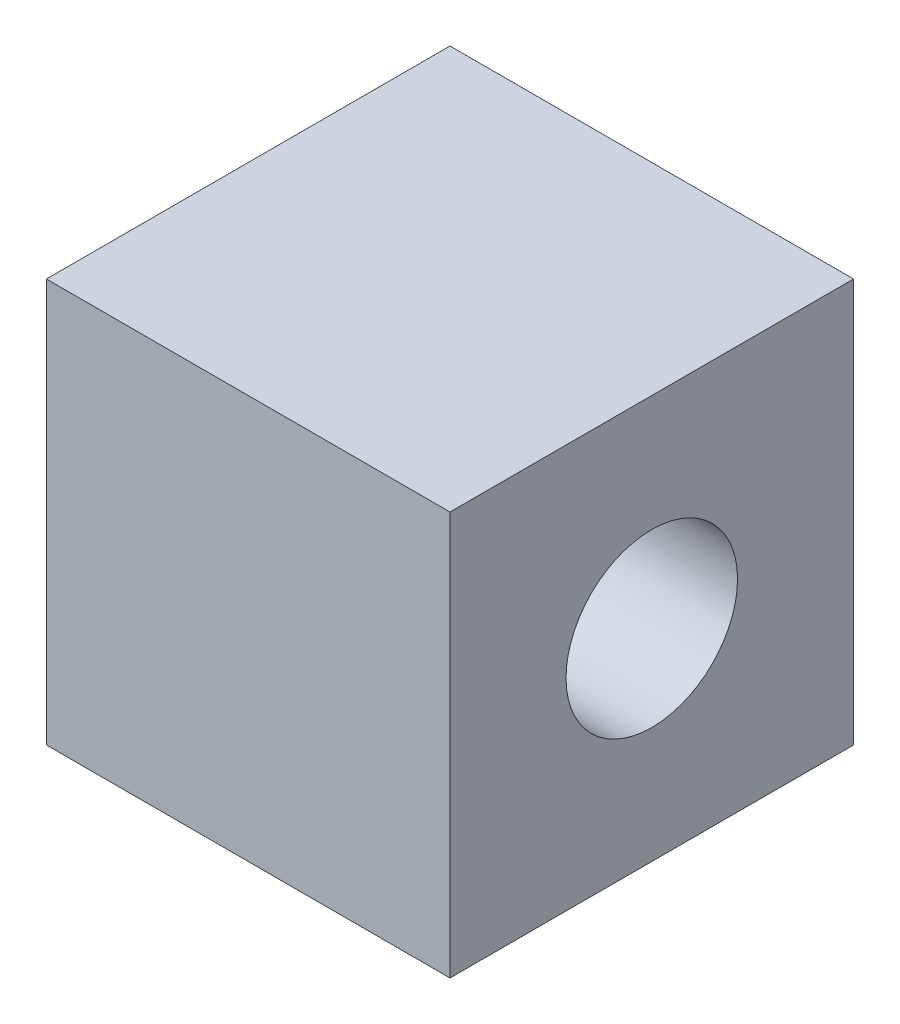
ISO-10303-21;
HEADER;
FILE_DESCRIPTION(('STEP AP214'),'2;1');
FILE_NAME('part.step','',(''),(''),'','','');
FILE_SCHEMA(('AUTOMOTIVE_DESIGN { 1 0 10303 214 1 1 1 1 }'));
ENDSEC;
DATA;
#1=APPLICATION_CONTEXT('core data for automotive mechanical design processes');
#2=APPLICATION_PROTOCOL_DEFINITION('international standard','automotive_design',2000,#1);
#3=PRODUCT_CONTEXT('',#1,'mechanical');
#4=PRODUCT('Part','Part','',(#3));
#5=PRODUCT_RELATED_PRODUCT_CATEGORY('part','',(#4));
#6=PRODUCT_DEFINITION_FORMATION('','',#4);
#7=PRODUCT_DEFINITION_CONTEXT('part definition',#1,'design');
#8=PRODUCT_DEFINITION('design','',#6,#7);
#9=PRODUCT_DEFINITION_SHAPE('','',#8);
#10=(LENGTH_UNIT() NAMED_UNIT(*) SI_UNIT(.MILLI.,.METRE.));
#11=(NAMED_UNIT(*) PLANE_ANGLE_UNIT() SI_UNIT($,.RADIAN.));
#12=(NAMED_UNIT(*) SI_UNIT($,.STERADIAN.) SOLID_ANGLE_UNIT());
#13=UNCERTAINTY_MEASURE_WITH_UNIT(LENGTH_MEASURE(1.E-05),#10,'distance_accuracy_value','');
#14=(GEOMETRIC_REPRESENTATION_CONTEXT(3) GLOBAL_UNCERTAINTY_ASSIGNED_CONTEXT((#13)) GLOBAL_UNIT_ASSIGNED_CONTEXT((#10,
#11,#12)) REPRESENTATION_CONTEXT('',''));
#15=CARTESIAN_POINT('',(0.,0.,0.));
#16=DIRECTION('',(0.,0.,1.));
#17=DIRECTION('',(1.,0.,0.));
#18=AXIS2_PLACEMENT_3D('',#15,#16,#17);
#19=CARTESIAN_POINT('',(20.,-10.,-10.));
#20=DIRECTION('',(0.,0.,1.));
#21=DIRECTION('',(1.,0.,0.));
#22=AXIS2_PLACEMENT_3D('',#19,#20,#21);
#23=PLANE('',#22);
#24=DIRECTION('',(0.,1.,0.));
#25=VECTOR('',#24,1.);
#26=CARTESIAN_POINT('',(0.,-10.,-10.));
#27=LINE('',#26,#25);
#28=CARTESIAN_POINT('',(0.,-10.,-10.));
#29=VERTEX_POINT('',#28);
#30=CARTESIAN_POINT('',(0.,10.,-10.));
#31=VERTEX_POINT('',#30);
#32=EDGE_CURVE('E113',#29,#31,#27,.T.);
#33=ORIENTED_EDGE('',*,*,#32,.T.);
#34=DIRECTION('',(-1.,0.,0.));
#35=VECTOR('',#34,1.);
#36=CARTESIAN_POINT('',(20.,10.,-10.));
#37=LINE('',#36,#35);
#38=CARTESIAN_POINT('',(20.,10.,-10.));
#39=VERTEX_POINT('',#38);
#40=EDGE_CURVE('E11',#39,#31,#37,.T.);
#41=ORIENTED_EDGE('',*,*,#40,.F.);
#42=DIRECTION('',(0.,1.,0.));
#43=VECTOR('',#42,1.);
#44=CARTESIAN_POINT('',(20.,-10.,-10.));
#45=LINE('',#44,#43);
#46=CARTESIAN_POINT('',(20.,-10.,-10.));
#47=VERTEX_POINT('',#46);
#48=EDGE_CURVE('E97',#47,#39,#45,.T.);
#49=ORIENTED_EDGE('',*,*,#48,.F.);
#50=DIRECTION('',(-1.,0.,0.));
#51=VECTOR('',#50,1.);
#52=CARTESIAN_POINT('',(20.,-10.,-10.));
#53=LINE('',#52,#51);
#54=EDGE_CURVE('E109',#47,#29,#53,.T.);
#55=ORIENTED_EDGE('',*,*,#54,.T.);
#56=EDGE_LOOP('',(#33,#41,#49,#55));
#57=FACE_BOUND('',#56,.T.);
#58=ADVANCED_FACE('F45',(#57),#23,.F.);
#59=CARTESIAN_POINT('',(20.,10.,10.));
#60=DIRECTION('',(0.,-1.,0.));
#61=DIRECTION('',(0.,0.,-1.));
#62=AXIS2_PLACEMENT_3D('',#59,#60,#61);
#63=PLANE('',#62);
#64=DIRECTION('',(0.,0.,1.));
#65=VECTOR('',#64,1.);
#66=CARTESIAN_POINT('',(0.,10.,10.));
#67=LINE('',#66,#65);
#68=CARTESIAN_POINT('',(0.,10.,10.));
#69=VERTEX_POINT('',#68);
#70=EDGE_CURVE('E102',#31,#69,#67,.T.);
#71=ORIENTED_EDGE('',*,*,#70,.T.);
#72=DIRECTION('',(-1.,0.,0.));
#73=VECTOR('',#72,1.);
#74=CARTESIAN_POINT('',(20.,10.,10.));
#75=LINE('',#74,#73);
#76=CARTESIAN_POINT('',(20.,10.,10.));
#77=VERTEX_POINT('',#76);
#78=EDGE_CURVE('E54',#77,#69,#75,.T.);
#79=ORIENTED_EDGE('',*,*,#78,.F.);
#80=DIRECTION('',(0.,0.,1.));
#81=VECTOR('',#80,1.);
#82=CARTESIAN_POINT('',(20.,10.,10.));
#83=LINE('',#82,#81);
#84=EDGE_CURVE('E92',#39,#77,#83,.T.);
#85=ORIENTED_EDGE('',*,*,#84,.F.);
#86=ORIENTED_EDGE('',*,*,#40,.T.);
#87=EDGE_LOOP('',(#71,#79,#85,#86));
#88=FACE_BOUND('',#87,.T.);
#89=ADVANCED_FACE('F101',(#88),#63,.F.);
#90=CARTESIAN_POINT('',(20.,-10.,10.));
#91=DIRECTION('',(0.,0.,-1.));
#92=DIRECTION('',(-1.,0.,0.));
#93=AXIS2_PLACEMENT_3D('',#90,#91,#92);
#94=PLANE('',#93);
#95=DIRECTION('',(0.,-1.,0.));
#96=VECTOR('',#95,1.);
#97=CARTESIAN_POINT('',(0.,-10.,10.));
#98=LINE('',#97,#96);
#99=CARTESIAN_POINT('',(0.,-10.,10.));
#100=VERTEX_POINT('',#99);
#101=EDGE_CURVE('E79',#69,#100,#98,.T.);
#102=ORIENTED_EDGE('',*,*,#101,.T.);
#103=DIRECTION('',(-1.,0.,0.));
#104=VECTOR('',#103,1.);
#105=CARTESIAN_POINT('',(20.,-10.,10.));
#106=LINE('',#105,#104);
#107=CARTESIAN_POINT('',(20.,-10.,10.));
#108=VERTEX_POINT('',#107);
#109=EDGE_CURVE('E104',#108,#100,#106,.T.);
#110=ORIENTED_EDGE('',*,*,#109,.F.);
#111=DIRECTION('',(0.,-1.,0.));
#112=VECTOR('',#111,1.);
#113=CARTESIAN_POINT('',(20.,-10.,10.));
#114=LINE('',#113,#112);
#115=EDGE_CURVE('E95',#77,#108,#114,.T.);
#116=ORIENTED_EDGE('',*,*,#115,.F.);
#117=ORIENTED_EDGE('',*,*,#78,.T.);
#118=EDGE_LOOP('',(#102,#110,#116,#117));
#119=FACE_BOUND('',#118,.T.);
#120=ADVANCED_FACE('F105',(#119),#94,.F.);
#121=CARTESIAN_POINT('',(20.,-10.,10.));
#122=DIRECTION('',(0.,1.,0.));
#123=DIRECTION('',(0.,0.,1.));
#124=AXIS2_PLACEMENT_3D('',#121,#122,#123);
#125=PLANE('',#124);
#126=DIRECTION('',(0.,0.,-1.));
#127=VECTOR('',#126,1.);
#128=CARTESIAN_POINT('',(0.,-10.,10.));
#129=LINE('',#128,#127);
#130=EDGE_CURVE('E85',#100,#29,#129,.T.);
#131=ORIENTED_EDGE('',*,*,#130,.T.);
#132=ORIENTED_EDGE('',*,*,#54,.F.);
#133=DIRECTION('',(0.,0.,-1.));
#134=VECTOR('',#133,1.);
#135=CARTESIAN_POINT('',(20.,-10.,10.));
#136=LINE('',#135,#134);
#137=EDGE_CURVE('E62',#108,#47,#136,.T.);
#138=ORIENTED_EDGE('',*,*,#137,.F.);
#139=ORIENTED_EDGE('',*,*,#109,.T.);
#140=EDGE_LOOP('',(#131,#132,#138,#139));
#141=FACE_BOUND('',#140,.T.);
#142=ADVANCED_FACE('F127',(#141),#125,.F.);
#143=CARTESIAN_POINT('',(20.,0.,0.));
#144=DIRECTION('',(-1.,0.,0.));
#145=DIRECTION('',(0.,0.,1.));
#146=AXIS2_PLACEMENT_3D('',#143,#144,#145);
#147=PLANE('',#146);
#148=CARTESIAN_POINT('',(20.,0.,0.));
#149=DIRECTION('',(1.,0.,0.));
#150=DIRECTION('',(0.,0.,-1.));
#151=AXIS2_PLACEMENT_3D('',#148,#149,#150);
#152=CIRCLE('',#151,4.25);
#153=CARTESIAN_POINT('',(20.,0.,-4.25));
#154=VERTEX_POINT('',#153);
#155=EDGE_CURVE('E134',#154,#154,#152,.T.);
#156=ORIENTED_EDGE('',*,*,#155,.F.);
#157=EDGE_LOOP('',(#156));
#158=FACE_BOUND('',#157,.T.);
#159=ORIENTED_EDGE('',*,*,#48,.T.);
#160=ORIENTED_EDGE('',*,*,#84,.T.);
#161=ORIENTED_EDGE('',*,*,#115,.T.);
#162=ORIENTED_EDGE('',*,*,#137,.T.);
#163=EDGE_LOOP('',(#159,#160,#161,#162));
#164=FACE_BOUND('',#163,.T.);
#165=ADVANCED_FACE('F93',(#158,#164),#147,.F.);
#166=CARTESIAN_POINT('',(0.,0.,0.));
#167=DIRECTION('',(-1.,0.,0.));
#168=DIRECTION('',(0.,0.,1.));
#169=AXIS2_PLACEMENT_3D('',#166,#167,#168);
#170=PLANE('',#169);
#171=CARTESIAN_POINT('',(0.,0.,0.));
#172=DIRECTION('',(1.,0.,0.));
#173=DIRECTION('',(0.,0.,-1.));
#174=AXIS2_PLACEMENT_3D('',#171,#172,#173);
#175=CIRCLE('',#174,4.25);
#176=CARTESIAN_POINT('',(0.,0.,-4.25));
#177=VERTEX_POINT('',#176);
#178=EDGE_CURVE('E117',#177,#177,#175,.T.);
#179=ORIENTED_EDGE('',*,*,#178,.T.);
#180=EDGE_LOOP('',(#179));
#181=FACE_BOUND('',#180,.T.);
#182=ORIENTED_EDGE('',*,*,#32,.F.);
#183=ORIENTED_EDGE('',*,*,#130,.F.);
#184=ORIENTED_EDGE('',*,*,#101,.F.);
#185=ORIENTED_EDGE('',*,*,#70,.F.);
#186=EDGE_LOOP('',(#182,#183,#184,#185));
#187=FACE_BOUND('',#186,.T.);
#188=ADVANCED_FACE('F130',(#181,#187),#170,.T.);
#189=CARTESIAN_POINT('',(0.,0.,0.));
#190=DIRECTION('',(1.,0.,0.));
#191=DIRECTION('',(0.,0.,-1.));
#192=AXIS2_PLACEMENT_3D('',#189,#190,#191);
#193=CYLINDRICAL_SURFACE('',#192,4.25);
#194=ORIENTED_EDGE('',*,*,#178,.F.);
#195=EDGE_LOOP('',(#194));
#196=FACE_BOUND('',#195,.T.);
#197=ORIENTED_EDGE('',*,*,#155,.T.);
#198=EDGE_LOOP('',(#197));
#199=FACE_BOUND('',#198,.T.);
#200=ADVANCED_FACE('F143',(#196,#199),#193,.F.);
#201=CLOSED_SHELL('',(#58,#89,#120,#142,#165,#188,#200));
#202=MANIFOLD_SOLID_BREP('B2',#201);
#203=ADVANCED_BREP_SHAPE_REPRESENTATION('',(#18,#202),#14);
#204=SHAPE_DEFINITION_REPRESENTATION(#9,#203);
ENDSEC;
END-ISO-10303-21;
